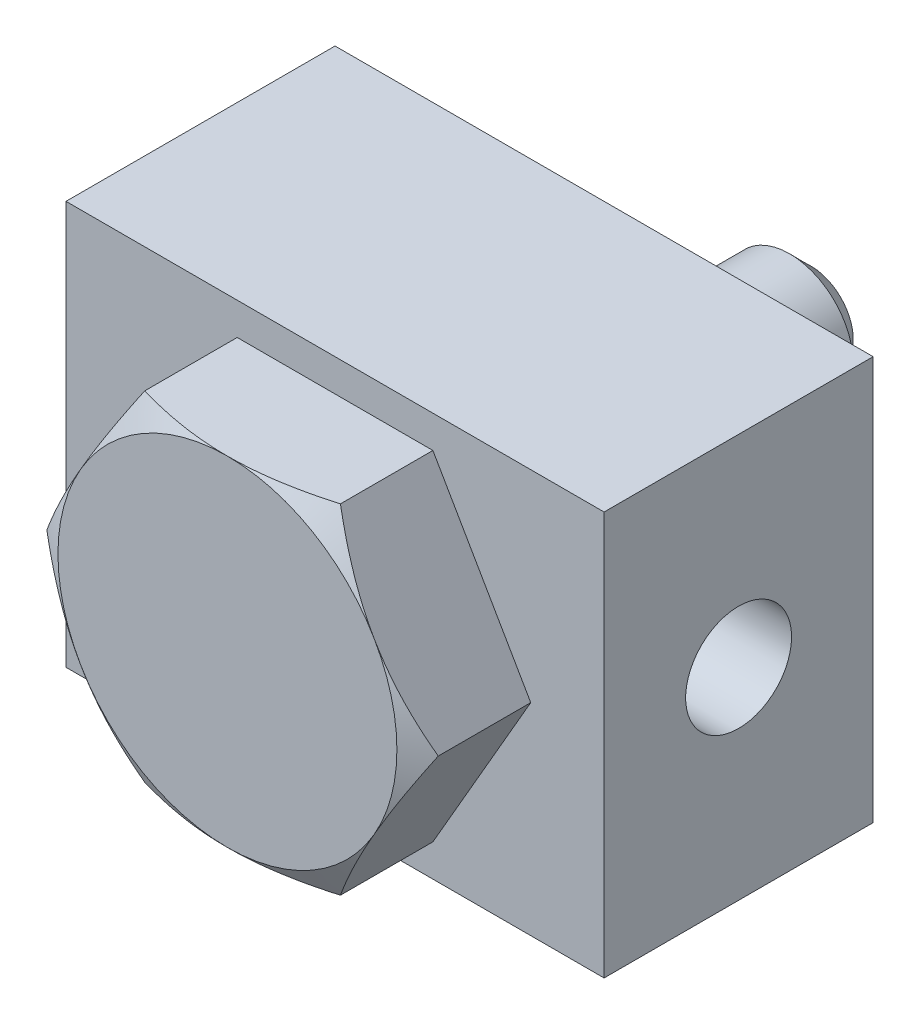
ISO-10303-21;
HEADER;
FILE_DESCRIPTION(('STEP AP214'),'2;1');
FILE_NAME('part.step','',(''),(''),'','','');
FILE_SCHEMA(('AUTOMOTIVE_DESIGN { 1 0 10303 214 1 1 1 1 }'));
ENDSEC;
DATA;
#1=APPLICATION_CONTEXT('core data for automotive mechanical design processes');
#2=APPLICATION_PROTOCOL_DEFINITION('international standard','automotive_design',2000,#1);
#3=PRODUCT_CONTEXT('',#1,'mechanical');
#4=PRODUCT('Part','Part','',(#3));
#5=PRODUCT_RELATED_PRODUCT_CATEGORY('part','',(#4));
#6=PRODUCT_DEFINITION_FORMATION('','',#4);
#7=PRODUCT_DEFINITION_CONTEXT('part definition',#1,'design');
#8=PRODUCT_DEFINITION('design','',#6,#7);
#9=PRODUCT_DEFINITION_SHAPE('','',#8);
#10=(LENGTH_UNIT() NAMED_UNIT(*) SI_UNIT(.MILLI.,.METRE.));
#11=(NAMED_UNIT(*) PLANE_ANGLE_UNIT() SI_UNIT($,.RADIAN.));
#12=(NAMED_UNIT(*) SI_UNIT($,.STERADIAN.) SOLID_ANGLE_UNIT());
#13=UNCERTAINTY_MEASURE_WITH_UNIT(LENGTH_MEASURE(1.E-05),#10,'distance_accuracy_value','');
#14=(GEOMETRIC_REPRESENTATION_CONTEXT(3) GLOBAL_UNCERTAINTY_ASSIGNED_CONTEXT((#13)) GLOBAL_UNIT_ASSIGNED_CONTEXT((#10,
#11,#12)) REPRESENTATION_CONTEXT('',''));
#15=CARTESIAN_POINT('',(0.,0.,0.));
#16=DIRECTION('',(0.,0.,1.));
#17=DIRECTION('',(1.,0.,0.));
#18=AXIS2_PLACEMENT_3D('',#15,#16,#17);
#19=CARTESIAN_POINT('',(25.4,-19.05,26.924));
#20=DIRECTION('',(0.,0.,1.));
#21=DIRECTION('',(0.,1.,0.));
#22=AXIS2_PLACEMENT_3D('',#19,#20,#21);
#23=PLANE('',#22);
#24=DIRECTION('',(0.,-1.,0.));
#25=VECTOR('',#24,1.);
#26=CARTESIAN_POINT('',(-25.4,0.,26.924));
#27=LINE('',#26,#25);
#28=CARTESIAN_POINT('',(-25.4,19.05,26.924));
#29=VERTEX_POINT('',#28);
#30=CARTESIAN_POINT('',(-25.4,-19.05,26.924));
#31=VERTEX_POINT('',#30);
#32=EDGE_CURVE('E270',#29,#31,#27,.T.);
#33=ORIENTED_EDGE('',*,*,#32,.T.);
#34=DIRECTION('',(1.,0.,0.));
#35=VECTOR('',#34,1.);
#36=CARTESIAN_POINT('',(0.,-19.05,26.924));
#37=LINE('',#36,#35);
#38=CARTESIAN_POINT('',(25.4,-19.05,26.924));
#39=VERTEX_POINT('',#38);
#40=EDGE_CURVE('E274',#31,#39,#37,.T.);
#41=ORIENTED_EDGE('',*,*,#40,.T.);
#42=DIRECTION('',(0.,1.,0.));
#43=VECTOR('',#42,1.);
#44=CARTESIAN_POINT('',(25.4,0.,26.924));
#45=LINE('',#44,#43);
#46=CARTESIAN_POINT('',(25.4,19.05,26.924));
#47=VERTEX_POINT('',#46);
#48=EDGE_CURVE('E281',#39,#47,#45,.T.);
#49=ORIENTED_EDGE('',*,*,#48,.T.);
#50=DIRECTION('',(-1.,0.,0.));
#51=VECTOR('',#50,1.);
#52=CARTESIAN_POINT('',(0.,19.05,26.924));
#53=LINE('',#52,#51);
#54=EDGE_CURVE('E289',#47,#29,#53,.T.);
#55=ORIENTED_EDGE('',*,*,#54,.T.);
#56=EDGE_LOOP('',(#33,#41,#49,#55));
#57=FACE_BOUND('',#56,.T.);
#58=DIRECTION('',(-0.5,-0.866025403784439,0.));
#59=VECTOR('',#58,1.);
#60=CARTESIAN_POINT('',(-9.23760430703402,16.,26.924));
#61=LINE('',#60,#59);
#62=CARTESIAN_POINT('',(-9.23760430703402,16.,26.924));
#63=VERTEX_POINT('',#62);
#64=CARTESIAN_POINT('',(-18.475208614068,0.,26.924));
#65=VERTEX_POINT('',#64);
#66=EDGE_CURVE('E368',#63,#65,#61,.T.);
#67=ORIENTED_EDGE('',*,*,#66,.F.);
#68=DIRECTION('',(-1.,0.,0.));
#69=VECTOR('',#68,1.);
#70=CARTESIAN_POINT('',(9.23760430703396,16.,26.924));
#71=LINE('',#70,#69);
#72=CARTESIAN_POINT('',(9.23760430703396,16.,26.924));
#73=VERTEX_POINT('',#72);
#74=EDGE_CURVE('E354',#73,#63,#71,.T.);
#75=ORIENTED_EDGE('',*,*,#74,.F.);
#76=DIRECTION('',(-0.5,0.866025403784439,0.));
#77=VECTOR('',#76,1.);
#78=CARTESIAN_POINT('',(18.475208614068,0.,26.924));
#79=LINE('',#78,#77);
#80=CARTESIAN_POINT('',(18.475208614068,0.,26.924));
#81=VERTEX_POINT('',#80);
#82=EDGE_CURVE('E357',#81,#73,#79,.T.);
#83=ORIENTED_EDGE('',*,*,#82,.F.);
#84=DIRECTION('',(0.5,0.866025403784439,0.));
#85=VECTOR('',#84,1.);
#86=CARTESIAN_POINT('',(9.23760430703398,-16.,26.924));
#87=LINE('',#86,#85);
#88=CARTESIAN_POINT('',(9.23760430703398,-16.,26.924));
#89=VERTEX_POINT('',#88);
#90=EDGE_CURVE('E360',#89,#81,#87,.T.);
#91=ORIENTED_EDGE('',*,*,#90,.F.);
#92=DIRECTION('',(1.,0.,0.));
#93=VECTOR('',#92,1.);
#94=CARTESIAN_POINT('',(-9.23760430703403,-16.,26.924));
#95=LINE('',#94,#93);
#96=CARTESIAN_POINT('',(-9.23760430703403,-16.,26.924));
#97=VERTEX_POINT('',#96);
#98=EDGE_CURVE('E363',#97,#89,#95,.T.);
#99=ORIENTED_EDGE('',*,*,#98,.F.);
#100=DIRECTION('',(0.5,-0.866025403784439,0.));
#101=VECTOR('',#100,1.);
#102=CARTESIAN_POINT('',(-18.475208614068,0.,26.924));
#103=LINE('',#102,#101);
#104=EDGE_CURVE('E366',#65,#97,#103,.T.);
#105=ORIENTED_EDGE('',*,*,#104,.F.);
#106=EDGE_LOOP('',(#67,#75,#83,#91,#99,#105));
#107=FACE_BOUND('',#106,.T.);
#108=ADVANCED_FACE('F14',(#57,#107),#23,.T.);
#109=CARTESIAN_POINT('',(-25.4,19.05,1.524));
#110=DIRECTION('',(0.,-1.,0.));
#111=DIRECTION('',(1.,0.,0.));
#112=AXIS2_PLACEMENT_3D('',#109,#110,#111);
#113=PLANE('',#112);
#114=DIRECTION('',(0.,0.,1.));
#115=VECTOR('',#114,1.);
#116=CARTESIAN_POINT('',(-25.4,19.05,14.224));
#117=LINE('',#116,#115);
#118=CARTESIAN_POINT('',(-25.4,19.05,1.524));
#119=VERTEX_POINT('',#118);
#120=EDGE_CURVE('E286',#119,#29,#117,.T.);
#121=ORIENTED_EDGE('',*,*,#120,.T.);
#122=ORIENTED_EDGE('',*,*,#54,.F.);
#123=DIRECTION('',(0.,0.,-1.));
#124=VECTOR('',#123,1.);
#125=CARTESIAN_POINT('',(25.4,19.05,14.224));
#126=LINE('',#125,#124);
#127=CARTESIAN_POINT('',(25.4,19.05,1.524));
#128=VERTEX_POINT('',#127);
#129=EDGE_CURVE('E331',#47,#128,#126,.T.);
#130=ORIENTED_EDGE('',*,*,#129,.T.);
#131=DIRECTION('',(-1.,0.,0.));
#132=VECTOR('',#131,1.);
#133=CARTESIAN_POINT('',(0.,19.05,1.524));
#134=LINE('',#133,#132);
#135=EDGE_CURVE('E335',#128,#119,#134,.T.);
#136=ORIENTED_EDGE('',*,*,#135,.T.);
#137=EDGE_LOOP('',(#121,#122,#130,#136));
#138=FACE_BOUND('',#137,.T.);
#139=ADVANCED_FACE('F221',(#138),#113,.F.);
#140=CARTESIAN_POINT('',(-25.4,-19.05,1.524));
#141=DIRECTION('',(1.,0.,0.));
#142=DIRECTION('',(0.,1.,0.));
#143=AXIS2_PLACEMENT_3D('',#140,#141,#142);
#144=PLANE('',#143);
#145=CARTESIAN_POINT('',(-25.4,0.,14.224));
#146=DIRECTION('',(1.,0.,0.));
#147=DIRECTION('',(0.,0.,-1.));
#148=AXIS2_PLACEMENT_3D('',#145,#146,#147);
#149=CIRCLE('',#148,5.);
#150=CARTESIAN_POINT('',(-25.4,0.,9.224));
#151=VERTEX_POINT('',#150);
#152=EDGE_CURVE('E132',#151,#151,#149,.T.);
#153=ORIENTED_EDGE('',*,*,#152,.T.);
#154=EDGE_LOOP('',(#153));
#155=FACE_BOUND('',#154,.T.);
#156=DIRECTION('',(0.,0.,1.));
#157=VECTOR('',#156,1.);
#158=CARTESIAN_POINT('',(-25.4,-19.05,14.224));
#159=LINE('',#158,#157);
#160=CARTESIAN_POINT('',(-25.4,-19.05,1.524));
#161=VERTEX_POINT('',#160);
#162=EDGE_CURVE('E267',#161,#31,#159,.T.);
#163=ORIENTED_EDGE('',*,*,#162,.T.);
#164=ORIENTED_EDGE('',*,*,#32,.F.);
#165=ORIENTED_EDGE('',*,*,#120,.F.);
#166=DIRECTION('',(0.,-1.,0.));
#167=VECTOR('',#166,1.);
#168=CARTESIAN_POINT('',(-25.4,0.,1.524));
#169=LINE('',#168,#167);
#170=EDGE_CURVE('E272',#119,#161,#169,.T.);
#171=ORIENTED_EDGE('',*,*,#170,.T.);
#172=EDGE_LOOP('',(#163,#164,#165,#171));
#173=FACE_BOUND('',#172,.T.);
#174=ADVANCED_FACE('F228',(#155,#173),#144,.F.);
#175=CARTESIAN_POINT('',(25.4,-19.05,1.524));
#176=DIRECTION('',(0.,1.,0.));
#177=DIRECTION('',(-1.,0.,0.));
#178=AXIS2_PLACEMENT_3D('',#175,#176,#177);
#179=PLANE('',#178);
#180=DIRECTION('',(0.,0.,1.));
#181=VECTOR('',#180,1.);
#182=CARTESIAN_POINT('',(25.4,-19.05,14.224));
#183=LINE('',#182,#181);
#184=CARTESIAN_POINT('',(25.4,-19.05,1.524));
#185=VERTEX_POINT('',#184);
#186=EDGE_CURVE('E278',#185,#39,#183,.T.);
#187=ORIENTED_EDGE('',*,*,#186,.T.);
#188=ORIENTED_EDGE('',*,*,#40,.F.);
#189=ORIENTED_EDGE('',*,*,#162,.F.);
#190=DIRECTION('',(1.,0.,0.));
#191=VECTOR('',#190,1.);
#192=CARTESIAN_POINT('',(0.,-19.05,1.524));
#193=LINE('',#192,#191);
#194=EDGE_CURVE('E340',#161,#185,#193,.T.);
#195=ORIENTED_EDGE('',*,*,#194,.T.);
#196=EDGE_LOOP('',(#187,#188,#189,#195));
#197=FACE_BOUND('',#196,.T.);
#198=ADVANCED_FACE('F252',(#197),#179,.F.);
#199=CARTESIAN_POINT('',(25.4,19.05,1.524));
#200=DIRECTION('',(-1.,0.,0.));
#201=DIRECTION('',(0.,-1.,0.));
#202=AXIS2_PLACEMENT_3D('',#199,#200,#201);
#203=PLANE('',#202);
#204=CARTESIAN_POINT('',(25.4,0.,14.224));
#205=DIRECTION('',(1.,0.,0.));
#206=DIRECTION('',(0.,0.,-1.));
#207=AXIS2_PLACEMENT_3D('',#204,#205,#206);
#208=CIRCLE('',#207,5.);
#209=CARTESIAN_POINT('',(25.4,0.,9.224));
#210=VERTEX_POINT('',#209);
#211=EDGE_CURVE('E326',#210,#210,#208,.T.);
#212=ORIENTED_EDGE('',*,*,#211,.F.);
#213=EDGE_LOOP('',(#212));
#214=FACE_BOUND('',#213,.T.);
#215=ORIENTED_EDGE('',*,*,#129,.F.);
#216=ORIENTED_EDGE('',*,*,#48,.F.);
#217=ORIENTED_EDGE('',*,*,#186,.F.);
#218=DIRECTION('',(0.,1.,0.));
#219=VECTOR('',#218,1.);
#220=CARTESIAN_POINT('',(25.4,0.,1.524));
#221=LINE('',#220,#219);
#222=EDGE_CURVE('E295',#185,#128,#221,.T.);
#223=ORIENTED_EDGE('',*,*,#222,.T.);
#224=EDGE_LOOP('',(#215,#216,#217,#223));
#225=FACE_BOUND('',#224,.T.);
#226=ADVANCED_FACE('F248',(#214,#225),#203,.F.);
#227=CARTESIAN_POINT('',(25.4,-19.05,1.524));
#228=DIRECTION('',(0.,0.,1.));
#229=DIRECTION('',(0.,1.,0.));
#230=AXIS2_PLACEMENT_3D('',#227,#228,#229);
#231=PLANE('',#230);
#232=CARTESIAN_POINT('',(0.,0.,1.524));
#233=DIRECTION('',(0.,0.,1.));
#234=DIRECTION('',(1.,0.,0.));
#235=AXIS2_PLACEMENT_3D('',#232,#233,#234);
#236=CIRCLE('',#235,12.6365);
#237=CARTESIAN_POINT('',(12.6365,0.,1.524));
#238=VERTEX_POINT('',#237);
#239=EDGE_CURVE('E293',#238,#238,#236,.T.);
#240=ORIENTED_EDGE('',*,*,#239,.T.);
#241=EDGE_LOOP('',(#240));
#242=FACE_BOUND('',#241,.T.);
#243=ORIENTED_EDGE('',*,*,#194,.F.);
#244=ORIENTED_EDGE('',*,*,#170,.F.);
#245=ORIENTED_EDGE('',*,*,#135,.F.);
#246=ORIENTED_EDGE('',*,*,#222,.F.);
#247=EDGE_LOOP('',(#243,#244,#245,#246));
#248=FACE_BOUND('',#247,.T.);
#249=ADVANCED_FACE('F241',(#242,#248),#231,.F.);
#250=CARTESIAN_POINT('',(0.,0.,0.));
#251=DIRECTION('',(0.,0.,1.));
#252=DIRECTION('',(1.,0.,0.));
#253=AXIS2_PLACEMENT_3D('',#250,#251,#252);
#254=CYLINDRICAL_SURFACE('',#253,12.6365);
#255=ORIENTED_EDGE('',*,*,#239,.F.);
#256=EDGE_LOOP('',(#255));
#257=FACE_BOUND('',#256,.T.);
#258=CARTESIAN_POINT('',(0.,0.,0.));
#259=DIRECTION('',(0.,0.,1.));
#260=DIRECTION('',(1.,0.,0.));
#261=AXIS2_PLACEMENT_3D('',#258,#259,#260);
#262=CIRCLE('',#261,12.6365);
#263=CARTESIAN_POINT('',(12.6365,0.,0.));
#264=VERTEX_POINT('',#263);
#265=EDGE_CURVE('E127',#264,#264,#262,.T.);
#266=ORIENTED_EDGE('',*,*,#265,.T.);
#267=EDGE_LOOP('',(#266));
#268=FACE_BOUND('',#267,.T.);
#269=ADVANCED_FACE('F234',(#257,#268),#254,.T.);
#270=CARTESIAN_POINT('',(12.788138,-12.788138,0.));
#271=DIRECTION('',(0.,0.,1.));
#272=DIRECTION('',(0.,1.,0.));
#273=AXIS2_PLACEMENT_3D('',#270,#271,#272);
#274=PLANE('',#273);
#275=CARTESIAN_POINT('',(0.,0.,0.));
#276=DIRECTION('',(0.,0.,1.));
#277=DIRECTION('',(1.,0.,0.));
#278=AXIS2_PLACEMENT_3D('',#275,#276,#277);
#279=CIRCLE('',#278,6.);
#280=CARTESIAN_POINT('',(6.,0.,0.));
#281=VERTEX_POINT('',#280);
#282=EDGE_CURVE('E297',#281,#281,#279,.F.);
#283=ORIENTED_EDGE('',*,*,#282,.F.);
#284=EDGE_LOOP('',(#283));
#285=FACE_BOUND('',#284,.T.);
#286=ORIENTED_EDGE('',*,*,#265,.F.);
#287=EDGE_LOOP('',(#286));
#288=FACE_BOUND('',#287,.T.);
#289=ADVANCED_FACE('F224',(#285,#288),#274,.F.);
#290=CARTESIAN_POINT('',(9.23760430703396,16.,85.9648074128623));
#291=DIRECTION('',(0.,-1.,0.));
#292=DIRECTION('',(0.,0.,-1.));
#293=AXIS2_PLACEMENT_3D('',#290,#291,#292);
#294=PLANE('',#293);
#295=DIRECTION('',(0.,0.,-1.));
#296=VECTOR('',#295,1.);
#297=CARTESIAN_POINT('',(-9.23760430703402,16.,85.9648074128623));
#298=LINE('',#297,#296);
#299=CARTESIAN_POINT('',(-9.23760430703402,16.,35.6549376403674));
#300=VERTEX_POINT('',#299);
#301=EDGE_CURVE('E352',#300,#63,#298,.T.);
#302=ORIENTED_EDGE('',*,*,#301,.F.);
#303=CARTESIAN_POINT('',(-24.7828534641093,16.,29.2903602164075));
#304=CARTESIAN_POINT('',(-24.4335876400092,16.,29.459767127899));
#305=CARTESIAN_POINT('',(-24.0839111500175,16.,29.6283269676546));
#306=CARTESIAN_POINT('',(-23.3836511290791,16.,29.9635606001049));
#307=CARTESIAN_POINT('',(-23.0330675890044,16.,30.1302343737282));
#308=CARTESIAN_POINT('',(-21.9797340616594,16.,30.6271828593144));
#309=CARTESIAN_POINT('',(-21.2755049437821,16.,30.9543342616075));
#310=CARTESIAN_POINT('',(-19.8584767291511,16.,31.6000921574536));
#311=CARTESIAN_POINT('',(-19.1456518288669,16.,31.9186421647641));
#312=CARTESIAN_POINT('',(-17.7143226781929,16.,32.5426708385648));
#313=CARTESIAN_POINT('',(-16.9958186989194,16.,32.8481501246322));
#314=CARTESIAN_POINT('',(-15.5288862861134,16.,33.4520887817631));
#315=CARTESIAN_POINT('',(-14.7802356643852,16.,33.7500112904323));
#316=CARTESIAN_POINT('',(-13.2741590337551,16.,34.3232355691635));
#317=CARTESIAN_POINT('',(-12.5167320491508,16.,34.5985347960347));
#318=CARTESIAN_POINT('',(-10.9933501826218,16.,35.1192587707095));
#319=CARTESIAN_POINT('',(-10.2274162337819,16.,35.3647442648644));
#320=CARTESIAN_POINT('',(-8.68448857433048,16.,35.8179568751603));
#321=CARTESIAN_POINT('',(-7.90749844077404,16.,36.0256959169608));
#322=CARTESIAN_POINT('',(-6.73574228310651,16.,36.3008931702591));
#323=CARTESIAN_POINT('',(-6.34518299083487,16.,36.3863734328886));
#324=CARTESIAN_POINT('',(-5.56140146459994,16.,36.5441763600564));
#325=CARTESIAN_POINT('',(-5.16817928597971,16.,36.6164992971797));
#326=CARTESIAN_POINT('',(-4.37934403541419,16.,36.7467093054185));
#327=CARTESIAN_POINT('',(-3.98373098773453,16.,36.8045965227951));
#328=CARTESIAN_POINT('',(-3.19053881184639,16.,36.9047786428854));
#329=CARTESIAN_POINT('',(-2.792959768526,16.,36.9470742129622));
#330=CARTESIAN_POINT('',(-2.00156556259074,16.,37.014704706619));
#331=CARTESIAN_POINT('',(-1.60776876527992,16.,37.0402532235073));
#332=CARTESIAN_POINT('',(-0.819448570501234,16.,37.0746762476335));
#333=CARTESIAN_POINT('',(-0.424925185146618,16.,37.0835510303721));
#334=CARTESIAN_POINT('',(0.364144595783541,16.,37.0844156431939));
#335=CARTESIAN_POINT('',(0.758690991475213,16.,37.0764053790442));
#336=CARTESIAN_POINT('',(1.5470954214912,16.,37.0436946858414));
#337=CARTESIAN_POINT('',(1.94095342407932,16.,37.0189935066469));
#338=CARTESIAN_POINT('',(2.88845903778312,16.,36.9400151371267));
#339=CARTESIAN_POINT('',(3.4414537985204,16.,36.8777663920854));
#340=CARTESIAN_POINT('',(4.54332219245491,16.,36.7237629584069));
#341=CARTESIAN_POINT('',(5.0921952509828,16.,36.632004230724));
#342=CARTESIAN_POINT('',(6.18530345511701,16.,36.4222451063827));
#343=CARTESIAN_POINT('',(6.72953461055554,16.,36.3042241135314));
#344=CARTESIAN_POINT('',(7.81252909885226,16.,36.0455404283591));
#345=CARTESIAN_POINT('',(8.35129251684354,16.,35.9048780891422));
#346=CARTESIAN_POINT('',(9.43514463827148,16.,35.6010235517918));
#347=CARTESIAN_POINT('',(9.98011296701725,16.,35.4374049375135));
#348=CARTESIAN_POINT('',(11.0646808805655,16.,35.0933385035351));
#349=CARTESIAN_POINT('',(11.6042804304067,16.,34.9128905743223));
#350=CARTESIAN_POINT('',(12.6783784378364,16.,34.5380239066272));
#351=CARTESIAN_POINT('',(13.2128785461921,16.,34.3436098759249));
#352=CARTESIAN_POINT('',(14.2774552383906,16.,33.9430906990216));
#353=CARTESIAN_POINT('',(14.8075318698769,16.,33.7369856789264));
#354=CARTESIAN_POINT('',(16.0410779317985,16.,33.2441875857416));
#355=CARTESIAN_POINT('',(16.7430164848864,16.,32.9536686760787));
#356=CARTESIAN_POINT('',(18.1410516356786,16.,32.358859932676));
#357=CARTESIAN_POINT('',(18.8371478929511,16.,32.0545693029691));
#358=CARTESIAN_POINT('',(20.2245621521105,16.,31.4349249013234));
#359=CARTESIAN_POINT('',(20.9158791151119,16.,31.1195688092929));
#360=CARTESIAN_POINT('',(22.2943699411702,16.,30.4799843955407));
#361=CARTESIAN_POINT('',(22.9815438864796,16.,30.155756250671));
#362=CARTESIAN_POINT('',(24.3531421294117,16.,29.4997147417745));
#363=CARTESIAN_POINT('',(25.037562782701,16.,29.1678937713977));
#364=CARTESIAN_POINT('',(26.4034728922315,16.,28.498274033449));
#365=CARTESIAN_POINT('',(27.0849623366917,16.,28.1604752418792));
#366=CARTESIAN_POINT('',(28.4453702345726,16.,27.4799504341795));
#367=CARTESIAN_POINT('',(29.1242889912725,16.,27.1372250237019));
#368=CARTESIAN_POINT('',(30.4800046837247,16.,26.4476006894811));
#369=CARTESIAN_POINT('',(31.1568016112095,16.,26.1007017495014));
#370=CARTESIAN_POINT('',(33.0738482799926,16.,25.1117976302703));
#371=CARTESIAN_POINT('',(34.3119474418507,16.,24.4656234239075));
#372=CARTESIAN_POINT('',(36.7835083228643,16.,23.1643877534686));
#373=CARTESIAN_POINT('',(38.0169698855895,16.,22.5093259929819));
#374=CARTESIAN_POINT('',(40.4772787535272,16.,21.1939634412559));
#375=CARTESIAN_POINT('',(41.7041348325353,16.,20.5336790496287));
#376=CARTESIAN_POINT('',(43.5422223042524,16.,19.5392744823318));
#377=CARTESIAN_POINT('',(44.1545360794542,16.,19.2071520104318));
#378=CARTESIAN_POINT('',(45.3785132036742,16.,18.5417128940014));
#379=CARTESIAN_POINT('',(45.9901765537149,16.,18.2083962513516));
#380=CARTESIAN_POINT('',(46.6015511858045,16.,17.8745507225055));
#381=B_SPLINE_CURVE_WITH_KNOTS('',3,(#303,#304,#305,#306,#307,#308,#309,#310,#311,#312,#313,
#314,#315,#316,#317,#318,#319,#320,#321,#322,#323,#324,#325,#326,#327,#328,#329,#330,#331,#332,
#333,#334,#335,#336,#337,#338,#339,#340,#341,#342,#343,#344,#345,#346,#347,#348,#349,#350,#351,
#352,#353,#354,#355,#356,#357,#358,#359,#360,#361,#362,#363,#364,#365,#366,#367,#368,#369,#370,
#371,#372,#373,#374,#375,#376,#377,#378,#379,#380),.UNSPECIFIED.,.F.,.F.,(4,2,2,2,2,2,2,2,2,2,2,
2,2,2,2,2,2,2,2,2,2,2,2,2,2,2,2,2,2,2,2,2,2,2,2,2,2,2,4),(0.,1.16454408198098,2.32909992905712,
4.65855780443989,7.00074953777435,9.3428301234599,11.7598056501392,14.1770525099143,
16.589288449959,19.0007609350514,20.1999878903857,21.3991899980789,22.5983799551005,
23.7975185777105,24.9810492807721,26.1645604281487,27.3480781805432,28.5316491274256,
30.2001870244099,31.8689533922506,33.5390331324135,35.2090868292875,36.915763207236,
38.6224506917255,40.3285655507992,42.0346620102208,44.313514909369,46.5924996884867,
48.8719651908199,51.1513852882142,53.4331985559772,55.7150209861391,57.9965652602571,
60.2781184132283,64.4677985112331,68.6576186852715,72.8373569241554,74.9271170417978,
77.0168738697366),.UNSPECIFIED.);
#382=CARTESIAN_POINT('',(0.,16.,37.084));
#383=VERTEX_POINT('',#382);
#384=EDGE_CURVE('E37',#300,#383,#381,.T.);
#385=ORIENTED_EDGE('',*,*,#384,.T.);
#386=CARTESIAN_POINT('',(9.23760430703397,16.,35.6549376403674));
#387=VERTEX_POINT('',#386);
#388=EDGE_CURVE('E193',#383,#387,#381,.T.);
#389=ORIENTED_EDGE('',*,*,#388,.T.);
#390=DIRECTION('',(0.,0.,-1.));
#391=VECTOR('',#390,1.);
#392=CARTESIAN_POINT('',(9.23760430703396,16.,85.9648074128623));
#393=LINE('',#392,#391);
#394=EDGE_CURVE('E350',#387,#73,#393,.T.);
#395=ORIENTED_EDGE('',*,*,#394,.T.);
#396=ORIENTED_EDGE('',*,*,#74,.T.);
#397=EDGE_LOOP('',(#302,#385,#389,#395,#396));
#398=FACE_BOUND('',#397,.T.);
#399=ADVANCED_FACE('F162',(#398),#294,.F.);
#400=CARTESIAN_POINT('',(18.475208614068,0.,85.9648074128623));
#401=DIRECTION('',(-0.866025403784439,-0.5,0.));
#402=DIRECTION('',(0.5,-0.866025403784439,0.));
#403=AXIS2_PLACEMENT_3D('',#400,#401,#402);
#404=PLANE('',#403);
#405=ORIENTED_EDGE('',*,*,#394,.F.);
#406=CARTESIAN_POINT('',(9.23748883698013,16.0002,35.6548709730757));
#407=CARTESIAN_POINT('',(9.44052768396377,15.6485264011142,35.7720876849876));
#408=CARTESIAN_POINT('',(9.64435849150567,15.2954810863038,35.8839853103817));
#409=CARTESIAN_POINT('',(10.0536545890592,14.5865594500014,36.0956638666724));
#410=CARTESIAN_POINT('',(10.2591203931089,14.2306822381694,36.1954408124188));
#411=CARTESIAN_POINT('',(10.672083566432,13.5154090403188,36.3815367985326));
#412=CARTESIAN_POINT('',(10.8795845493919,13.1560067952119,36.4678239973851));
#413=CARTESIAN_POINT('',(11.296028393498,12.4347048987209,36.62508765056));
#414=CARTESIAN_POINT('',(11.5049711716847,12.0728053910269,36.6960649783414));
#415=CARTESIAN_POINT('',(11.918944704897,11.3557821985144,36.8196899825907));
#416=CARTESIAN_POINT('',(12.123944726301,11.00071174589,36.8727468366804));
#417=CARTESIAN_POINT('',(12.5348841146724,10.2889438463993,36.9617113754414));
#418=CARTESIAN_POINT('',(12.7408234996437,9.9322463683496,36.9976187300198));
#419=CARTESIAN_POINT('',(13.1530482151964,9.21825221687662,37.0513776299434));
#420=CARTESIAN_POINT('',(13.3593328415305,8.86095676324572,37.0692506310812));
#421=CARTESIAN_POINT('',(13.7720925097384,8.14603604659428,37.0865564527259));
#422=CARTESIAN_POINT('',(13.9785675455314,7.78841079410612,37.0859898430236));
#423=CARTESIAN_POINT('',(14.3645705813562,7.11983392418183,37.0677045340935));
#424=CARTESIAN_POINT('',(14.5441260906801,6.80883465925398,37.0522162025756));
#425=CARTESIAN_POINT('',(14.902824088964,6.18755150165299,37.0075864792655));
#426=CARTESIAN_POINT('',(15.0819665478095,5.87726766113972,36.9784441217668));
#427=CARTESIAN_POINT('',(15.4397411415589,5.2575838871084,36.9070144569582));
#428=CARTESIAN_POINT('',(15.6183727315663,4.94818489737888,36.8647162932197));
#429=CARTESIAN_POINT('',(15.9747984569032,4.33083743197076,36.7677171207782));
#430=CARTESIAN_POINT('',(16.1525925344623,4.02288905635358,36.7130152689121));
#431=CARTESIAN_POINT('',(16.6922962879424,3.08809473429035,36.5289213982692));
#432=CARTESIAN_POINT('',(17.0526430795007,2.46395578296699,36.3811733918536));
#433=CARTESIAN_POINT('',(17.7679634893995,1.2249844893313,36.0458459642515));
#434=CARTESIAN_POINT('',(18.1229462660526,0.610136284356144,35.8583452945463));
#435=CARTESIAN_POINT('',(18.4753240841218,-0.00019999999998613,35.6548709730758));
#436=B_SPLINE_CURVE_WITH_KNOTS('',3,(#406,#407,#408,#409,#410,#411,#412,#413,#414,#415,#416,
#417,#418,#419,#420,#421,#422,#423,#424,#425,#426,#427,#428,#429,#430,#431,#432,#433,#434,#435),
.UNSPECIFIED.,.F.,.F.,(4,2,2,2,2,2,2,2,2,2,2,2,2,2,4),(0.,1.26800386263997,2.53642350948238,
3.80779337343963,5.07909068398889,6.31900943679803,7.55895205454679,8.7974177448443,
10.0358451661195,11.1139198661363,12.1920708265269,13.2711138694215,14.350230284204,
16.555917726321,18.7572757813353),.UNSPECIFIED.);
#437=CARTESIAN_POINT('',(13.856406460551,8.,37.084));
#438=VERTEX_POINT('',#437);
#439=EDGE_CURVE('E191',#387,#438,#436,.T.);
#440=ORIENTED_EDGE('',*,*,#439,.T.);
#441=CARTESIAN_POINT('',(18.475208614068,0.,35.6549376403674));
#442=VERTEX_POINT('',#441);
#443=EDGE_CURVE('E185',#438,#442,#436,.T.);
#444=ORIENTED_EDGE('',*,*,#443,.T.);
#445=DIRECTION('',(0.,0.,-1.));
#446=VECTOR('',#445,1.);
#447=CARTESIAN_POINT('',(18.475208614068,0.,85.9648074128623));
#448=LINE('',#447,#446);
#449=EDGE_CURVE('E348',#442,#81,#448,.T.);
#450=ORIENTED_EDGE('',*,*,#449,.T.);
#451=ORIENTED_EDGE('',*,*,#82,.T.);
#452=EDGE_LOOP('',(#405,#440,#444,#450,#451));
#453=FACE_BOUND('',#452,.T.);
#454=ADVANCED_FACE('F199',(#453),#404,.F.);
#455=CARTESIAN_POINT('',(9.23760430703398,-16.,85.9648074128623));
#456=DIRECTION('',(-0.866025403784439,0.5,0.));
#457=DIRECTION('',(-0.5,-0.866025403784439,0.));
#458=AXIS2_PLACEMENT_3D('',#455,#456,#457);
#459=PLANE('',#458);
#460=ORIENTED_EDGE('',*,*,#449,.F.);
#461=CARTESIAN_POINT('',(18.4753240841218,0.000200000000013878,35.6548709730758));
#462=CARTESIAN_POINT('',(18.2722852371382,-0.351473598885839,35.7720876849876));
#463=CARTESIAN_POINT('',(18.0684544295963,-0.704518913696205,35.8839853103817));
#464=CARTESIAN_POINT('',(17.6591583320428,-1.41344054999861,36.0956638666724));
#465=CARTESIAN_POINT('',(17.4536925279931,-1.76931776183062,36.1954408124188));
#466=CARTESIAN_POINT('',(17.0407293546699,-2.48459095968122,36.3815367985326));
#467=CARTESIAN_POINT('',(16.8332283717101,-2.84399320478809,36.4678239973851));
#468=CARTESIAN_POINT('',(16.416784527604,-3.56529510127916,36.62508765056));
#469=CARTESIAN_POINT('',(16.2078417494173,-3.92719460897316,36.6960649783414));
#470=CARTESIAN_POINT('',(15.793868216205,-4.64421780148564,36.8196899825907));
#471=CARTESIAN_POINT('',(15.588868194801,-4.99928825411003,36.8727468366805));
#472=CARTESIAN_POINT('',(15.1779288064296,-5.71105615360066,36.9617113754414));
#473=CARTESIAN_POINT('',(14.9719894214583,-6.06775363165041,36.9976187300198));
#474=CARTESIAN_POINT('',(14.5597647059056,-6.78174778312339,37.0513776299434));
#475=CARTESIAN_POINT('',(14.3534800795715,-7.13904323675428,37.0692506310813));
#476=CARTESIAN_POINT('',(13.9407204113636,-7.85396395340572,37.0865564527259));
#477=CARTESIAN_POINT('',(13.7342453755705,-8.21158920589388,37.0859898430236));
#478=CARTESIAN_POINT('',(13.3482423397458,-8.88016607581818,37.0677045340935));
#479=CARTESIAN_POINT('',(13.1686868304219,-9.19116534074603,37.0522162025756));
#480=CARTESIAN_POINT('',(12.809988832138,-9.81244849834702,37.0075864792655));
#481=CARTESIAN_POINT('',(12.6308463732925,-10.1227323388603,36.9784441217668));
#482=CARTESIAN_POINT('',(12.273071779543,-10.7424161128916,36.9070144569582));
#483=CARTESIAN_POINT('',(12.0944401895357,-11.0518151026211,36.8647162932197));
#484=CARTESIAN_POINT('',(11.7380144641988,-11.6691625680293,36.7677171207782));
#485=CARTESIAN_POINT('',(11.5602203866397,-11.9771109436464,36.7130152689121));
#486=CARTESIAN_POINT('',(11.0205166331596,-12.9119052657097,36.5289213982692));
#487=CARTESIAN_POINT('',(10.6601698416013,-13.536044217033,36.3811733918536));
#488=CARTESIAN_POINT('',(9.9448494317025,-14.7750155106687,36.0458459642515));
#489=CARTESIAN_POINT('',(9.58986665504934,-15.3898637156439,35.8583452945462));
#490=CARTESIAN_POINT('',(9.23748883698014,-16.0002,35.6548709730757));
#491=B_SPLINE_CURVE_WITH_KNOTS('',3,(#461,#462,#463,#464,#465,#466,#467,#468,#469,#470,#471,
#472,#473,#474,#475,#476,#477,#478,#479,#480,#481,#482,#483,#484,#485,#486,#487,#488,#489,#490),
.UNSPECIFIED.,.F.,.F.,(4,2,2,2,2,2,2,2,2,2,2,2,2,2,4),(0.,1.26800386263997,2.53642350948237,
3.80779337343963,5.07909068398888,6.31900943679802,7.55895205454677,8.79741774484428,
10.0358451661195,11.1139198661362,12.1920708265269,13.2711138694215,14.350230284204,
16.5559177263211,18.7572757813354),.UNSPECIFIED.);
#492=CARTESIAN_POINT('',(13.856406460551,-8.,37.084));
#493=VERTEX_POINT('',#492);
#494=EDGE_CURVE('E192',#442,#493,#491,.T.);
#495=ORIENTED_EDGE('',*,*,#494,.T.);
#496=CARTESIAN_POINT('',(9.23760430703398,-16.,35.6549376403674));
#497=VERTEX_POINT('',#496);
#498=EDGE_CURVE('E178',#493,#497,#491,.T.);
#499=ORIENTED_EDGE('',*,*,#498,.T.);
#500=DIRECTION('',(0.,0.,-1.));
#501=VECTOR('',#500,1.);
#502=CARTESIAN_POINT('',(9.23760430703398,-16.,85.9648074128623));
#503=LINE('',#502,#501);
#504=EDGE_CURVE('E346',#497,#89,#503,.T.);
#505=ORIENTED_EDGE('',*,*,#504,.T.);
#506=ORIENTED_EDGE('',*,*,#90,.T.);
#507=EDGE_LOOP('',(#460,#495,#499,#505,#506));
#508=FACE_BOUND('',#507,.T.);
#509=ADVANCED_FACE('F202',(#508),#459,.F.);
#510=CARTESIAN_POINT('',(-9.23760430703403,-16.,85.9648074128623));
#511=DIRECTION('',(0.,1.,0.));
#512=DIRECTION('',(0.,0.,1.));
#513=AXIS2_PLACEMENT_3D('',#510,#511,#512);
#514=PLANE('',#513);
#515=ORIENTED_EDGE('',*,*,#504,.F.);
#516=CARTESIAN_POINT('',(-24.7828534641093,-16.,29.2903602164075));
#517=CARTESIAN_POINT('',(-24.4335876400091,-16.,29.4597671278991));
#518=CARTESIAN_POINT('',(-24.0839111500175,-16.,29.6283269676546));
#519=CARTESIAN_POINT('',(-23.383651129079,-16.,29.9635606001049));
#520=CARTESIAN_POINT('',(-23.0330675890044,-16.,30.1302343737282));
#521=CARTESIAN_POINT('',(-21.9797340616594,-16.,30.6271828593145));
#522=CARTESIAN_POINT('',(-21.275504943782,-16.,30.9543342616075));
#523=CARTESIAN_POINT('',(-19.8584767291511,-16.,31.6000921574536));
#524=CARTESIAN_POINT('',(-19.1456518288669,-16.,31.9186421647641));
#525=CARTESIAN_POINT('',(-17.7143226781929,-16.,32.5426708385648));
#526=CARTESIAN_POINT('',(-16.9958186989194,-16.,32.8481501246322));
#527=CARTESIAN_POINT('',(-15.5288862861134,-16.,33.4520887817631));
#528=CARTESIAN_POINT('',(-14.7802356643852,-16.,33.7500112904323));
#529=CARTESIAN_POINT('',(-13.2741590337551,-16.,34.3232355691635));
#530=CARTESIAN_POINT('',(-12.5167320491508,-16.,34.5985347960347));
#531=CARTESIAN_POINT('',(-10.9933501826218,-16.,35.1192587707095));
#532=CARTESIAN_POINT('',(-10.2274162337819,-16.,35.3647442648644));
#533=CARTESIAN_POINT('',(-8.68448857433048,-16.,35.8179568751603));
#534=CARTESIAN_POINT('',(-7.90749844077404,-16.,36.0256959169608));
#535=CARTESIAN_POINT('',(-6.73574228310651,-16.,36.3008931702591));
#536=CARTESIAN_POINT('',(-6.34518299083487,-16.,36.3863734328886));
#537=CARTESIAN_POINT('',(-5.56140146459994,-16.,36.5441763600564));
#538=CARTESIAN_POINT('',(-5.16817928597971,-16.,36.6164992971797));
#539=CARTESIAN_POINT('',(-4.3793440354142,-16.,36.7467093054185));
#540=CARTESIAN_POINT('',(-3.98373098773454,-16.,36.8045965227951));
#541=CARTESIAN_POINT('',(-3.1905388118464,-16.,36.9047786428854));
#542=CARTESIAN_POINT('',(-2.79295976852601,-16.,36.9470742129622));
#543=CARTESIAN_POINT('',(-2.00156556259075,-16.,37.014704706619));
#544=CARTESIAN_POINT('',(-1.60776876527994,-16.,37.0402532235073));
#545=CARTESIAN_POINT('',(-0.819448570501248,-16.,37.0746762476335));
#546=CARTESIAN_POINT('',(-0.424925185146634,-16.,37.0835510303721));
#547=CARTESIAN_POINT('',(0.364144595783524,-16.,37.0844156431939));
#548=CARTESIAN_POINT('',(0.758690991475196,-16.,37.0764053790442));
#549=CARTESIAN_POINT('',(1.54709542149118,-16.,37.0436946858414));
#550=CARTESIAN_POINT('',(1.9409534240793,-16.,37.0189935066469));
#551=CARTESIAN_POINT('',(2.88845903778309,-16.,36.9400151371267));
#552=CARTESIAN_POINT('',(3.44145379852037,-16.,36.8777663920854));
#553=CARTESIAN_POINT('',(4.54332219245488,-16.,36.7237629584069));
#554=CARTESIAN_POINT('',(5.09219525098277,-16.,36.632004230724));
#555=CARTESIAN_POINT('',(6.18530345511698,-16.,36.4222451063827));
#556=CARTESIAN_POINT('',(6.72953461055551,-16.,36.3042241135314));
#557=CARTESIAN_POINT('',(7.81252909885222,-16.,36.0455404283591));
#558=CARTESIAN_POINT('',(8.35129251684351,-16.,35.9048780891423));
#559=CARTESIAN_POINT('',(9.43514463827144,-16.,35.6010235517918));
#560=CARTESIAN_POINT('',(9.98011296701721,-16.,35.4374049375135));
#561=CARTESIAN_POINT('',(11.0646808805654,-16.,35.0933385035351));
#562=CARTESIAN_POINT('',(11.6042804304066,-16.,34.9128905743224));
#563=CARTESIAN_POINT('',(12.6783784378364,-16.,34.5380239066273));
#564=CARTESIAN_POINT('',(13.2128785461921,-16.,34.3436098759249));
#565=CARTESIAN_POINT('',(14.2774552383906,-16.,33.9430906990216));
#566=CARTESIAN_POINT('',(14.8075318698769,-16.,33.7369856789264));
#567=CARTESIAN_POINT('',(16.0410779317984,-16.,33.2441875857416));
#568=CARTESIAN_POINT('',(16.7430164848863,-16.,32.9536686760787));
#569=CARTESIAN_POINT('',(18.1410516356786,-16.,32.358859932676));
#570=CARTESIAN_POINT('',(18.8371478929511,-16.,32.0545693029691));
#571=CARTESIAN_POINT('',(20.2245621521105,-16.,31.4349249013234));
#572=CARTESIAN_POINT('',(20.9158791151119,-16.,31.1195688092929));
#573=CARTESIAN_POINT('',(22.2943699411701,-16.,30.4799843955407));
#574=CARTESIAN_POINT('',(22.9815438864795,-16.,30.155756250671));
#575=CARTESIAN_POINT('',(24.3531421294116,-16.,29.4997147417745));
#576=CARTESIAN_POINT('',(25.037562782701,-16.,29.1678937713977));
#577=CARTESIAN_POINT('',(26.4034728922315,-16.,28.498274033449));
#578=CARTESIAN_POINT('',(27.0849623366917,-16.,28.1604752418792));
#579=CARTESIAN_POINT('',(28.4453702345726,-16.,27.4799504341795));
#580=CARTESIAN_POINT('',(29.1242889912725,-16.,27.1372250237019));
#581=CARTESIAN_POINT('',(30.4800046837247,-16.,26.4476006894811));
#582=CARTESIAN_POINT('',(31.1568016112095,-16.,26.1007017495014));
#583=CARTESIAN_POINT('',(33.0738482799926,-16.,25.1117976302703));
#584=CARTESIAN_POINT('',(34.3119474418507,-16.,24.4656234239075));
#585=CARTESIAN_POINT('',(36.7835083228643,-16.,23.1643877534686));
#586=CARTESIAN_POINT('',(38.0169698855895,-16.,22.5093259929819));
#587=CARTESIAN_POINT('',(40.4772787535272,-16.,21.1939634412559));
#588=CARTESIAN_POINT('',(41.7041348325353,-16.,20.5336790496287));
#589=CARTESIAN_POINT('',(43.5422223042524,-16.,19.5392744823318));
#590=CARTESIAN_POINT('',(44.1545360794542,-16.,19.2071520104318));
#591=CARTESIAN_POINT('',(45.3785132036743,-16.,18.5417128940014));
#592=CARTESIAN_POINT('',(45.990176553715,-16.,18.2083962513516));
#593=CARTESIAN_POINT('',(46.6015511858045,-16.,17.8745507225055));
#594=B_SPLINE_CURVE_WITH_KNOTS('',3,(#516,#517,#518,#519,#520,#521,#522,#523,#524,#525,#526,
#527,#528,#529,#530,#531,#532,#533,#534,#535,#536,#537,#538,#539,#540,#541,#542,#543,#544,#545,
#546,#547,#548,#549,#550,#551,#552,#553,#554,#555,#556,#557,#558,#559,#560,#561,#562,#563,#564,
#565,#566,#567,#568,#569,#570,#571,#572,#573,#574,#575,#576,#577,#578,#579,#580,#581,#582,#583,
#584,#585,#586,#587,#588,#589,#590,#591,#592,#593),.UNSPECIFIED.,.F.,.F.,(4,2,2,2,2,2,2,2,2,2,2,
2,2,2,2,2,2,2,2,2,2,2,2,2,2,2,2,2,2,2,2,2,2,2,2,2,2,2,4),(0.,1.16454408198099,2.32909992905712,
4.65855780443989,7.00074953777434,9.34283012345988,11.7598056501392,14.1770525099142,
16.589288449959,19.0007609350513,20.1999878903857,21.3991899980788,22.5983799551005,
23.7975185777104,24.981049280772,26.1645604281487,27.3480781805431,28.5316491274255,
30.2001870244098,31.8689533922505,33.5390331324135,35.2090868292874,36.9157632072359,
38.6224506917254,40.3285655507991,42.0346620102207,44.3135149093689,46.5924996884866,
48.8719651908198,51.1513852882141,53.4331985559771,55.7150209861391,57.996565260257,
60.2781184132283,64.4677985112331,68.6576186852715,72.8373569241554,74.9271170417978,
77.0168738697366),.UNSPECIFIED.);
#595=CARTESIAN_POINT('',(0.,-16.,37.084));
#596=VERTEX_POINT('',#595);
#597=EDGE_CURVE('E386',#497,#596,#594,.F.);
#598=ORIENTED_EDGE('',*,*,#597,.T.);
#599=CARTESIAN_POINT('',(-9.23760430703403,-16.,35.6549376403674));
#600=VERTEX_POINT('',#599);
#601=EDGE_CURVE('E171',#596,#600,#594,.F.);
#602=ORIENTED_EDGE('',*,*,#601,.T.);
#603=DIRECTION('',(0.,0.,-1.));
#604=VECTOR('',#603,1.);
#605=CARTESIAN_POINT('',(-9.23760430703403,-16.,85.9648074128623));
#606=LINE('',#605,#604);
#607=EDGE_CURVE('E344',#600,#97,#606,.T.);
#608=ORIENTED_EDGE('',*,*,#607,.T.);
#609=ORIENTED_EDGE('',*,*,#98,.T.);
#610=EDGE_LOOP('',(#515,#598,#602,#608,#609));
#611=FACE_BOUND('',#610,.T.);
#612=ADVANCED_FACE('F206',(#611),#514,.F.);
#613=CARTESIAN_POINT('',(-18.475208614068,0.,85.9648074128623));
#614=DIRECTION('',(0.866025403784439,0.5,0.));
#615=DIRECTION('',(-0.5,0.866025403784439,0.));
#616=AXIS2_PLACEMENT_3D('',#613,#614,#615);
#617=PLANE('',#616);
#618=ORIENTED_EDGE('',*,*,#607,.F.);
#619=CARTESIAN_POINT('',(-9.23748883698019,-16.0002,35.6548709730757));
#620=CARTESIAN_POINT('',(-9.44052768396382,-15.6485264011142,35.7720876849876));
#621=CARTESIAN_POINT('',(-9.64435849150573,-15.2954810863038,35.8839853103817));
#622=CARTESIAN_POINT('',(-10.0536545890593,-14.5865594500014,36.0956638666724));
#623=CARTESIAN_POINT('',(-10.2591203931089,-14.2306822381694,36.1954408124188));
#624=CARTESIAN_POINT('',(-10.6720835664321,-13.5154090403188,36.3815367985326));
#625=CARTESIAN_POINT('',(-10.8795845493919,-13.1560067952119,36.4678239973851));
#626=CARTESIAN_POINT('',(-11.296028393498,-12.4347048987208,36.62508765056));
#627=CARTESIAN_POINT('',(-11.5049711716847,-12.0728053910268,36.6960649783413));
#628=CARTESIAN_POINT('',(-11.918944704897,-11.3557821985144,36.8196899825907));
#629=CARTESIAN_POINT('',(-12.123944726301,-11.00071174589,36.8727468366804));
#630=CARTESIAN_POINT('',(-12.5348841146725,-10.2889438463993,36.9617113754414));
#631=CARTESIAN_POINT('',(-12.7408234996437,-9.93224636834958,36.9976187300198));
#632=CARTESIAN_POINT('',(-13.1530482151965,-9.2182522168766,37.0513776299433));
#633=CARTESIAN_POINT('',(-13.3593328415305,-8.8609567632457,37.0692506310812));
#634=CARTESIAN_POINT('',(-13.7720925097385,-8.14603604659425,37.0865564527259));
#635=CARTESIAN_POINT('',(-13.9785675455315,-7.78841079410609,37.0859898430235));
#636=CARTESIAN_POINT('',(-14.3645705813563,-7.1198339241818,37.0677045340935));
#637=CARTESIAN_POINT('',(-14.5441260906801,-6.80883465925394,37.0522162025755));
#638=CARTESIAN_POINT('',(-14.902824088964,-6.18755150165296,37.0075864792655));
#639=CARTESIAN_POINT('',(-15.0819665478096,-5.87726766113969,36.9784441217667));
#640=CARTESIAN_POINT('',(-15.439741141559,-5.25758388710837,36.9070144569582));
#641=CARTESIAN_POINT('',(-15.6183727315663,-4.94818489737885,36.8647162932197));
#642=CARTESIAN_POINT('',(-15.9747984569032,-4.33083743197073,36.7677171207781));
#643=CARTESIAN_POINT('',(-16.1525925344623,-4.02288905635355,36.7130152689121));
#644=CARTESIAN_POINT('',(-16.6922962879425,-3.08809473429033,36.5289213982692));
#645=CARTESIAN_POINT('',(-17.0526430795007,-2.46395578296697,36.3811733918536));
#646=CARTESIAN_POINT('',(-17.7679634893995,-1.22498448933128,36.0458459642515));
#647=CARTESIAN_POINT('',(-18.1229462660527,-0.610136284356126,35.8583452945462));
#648=CARTESIAN_POINT('',(-18.4753240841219,0.000199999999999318,35.6548709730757));
#649=B_SPLINE_CURVE_WITH_KNOTS('',3,(#619,#620,#621,#622,#623,#624,#625,#626,#627,#628,#629,
#630,#631,#632,#633,#634,#635,#636,#637,#638,#639,#640,#641,#642,#643,#644,#645,#646,#647,#648),
.UNSPECIFIED.,.F.,.F.,(4,2,2,2,2,2,2,2,2,2,2,2,2,2,4),(0.,1.26800386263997,2.53642350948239,
3.80779337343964,5.0790906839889,6.31900943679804,7.5589520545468,8.79741774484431,
10.0358451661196,11.1139198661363,12.1920708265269,13.2711138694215,14.350230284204,
16.5559177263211,18.7572757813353),.UNSPECIFIED.);
#650=CARTESIAN_POINT('',(-13.856406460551,-8.,37.084));
#651=VERTEX_POINT('',#650);
#652=EDGE_CURVE('E138',#600,#651,#649,.T.);
#653=ORIENTED_EDGE('',*,*,#652,.T.);
#654=CARTESIAN_POINT('',(-18.475208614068,0.,35.6549376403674));
#655=VERTEX_POINT('',#654);
#656=EDGE_CURVE('E123',#651,#655,#649,.T.);
#657=ORIENTED_EDGE('',*,*,#656,.T.);
#658=DIRECTION('',(0.,0.,-1.));
#659=VECTOR('',#658,1.);
#660=CARTESIAN_POINT('',(-18.475208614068,0.,85.9648074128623));
#661=LINE('',#660,#659);
#662=EDGE_CURVE('E137',#655,#65,#661,.T.);
#663=ORIENTED_EDGE('',*,*,#662,.T.);
#664=ORIENTED_EDGE('',*,*,#104,.T.);
#665=EDGE_LOOP('',(#618,#653,#657,#663,#664));
#666=FACE_BOUND('',#665,.T.);
#667=ADVANCED_FACE('F210',(#666),#617,.F.);
#668=CARTESIAN_POINT('',(-9.23760430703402,16.,85.9648074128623));
#669=DIRECTION('',(0.866025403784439,-0.5,0.));
#670=DIRECTION('',(0.5,0.866025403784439,0.));
#671=AXIS2_PLACEMENT_3D('',#668,#669,#670);
#672=PLANE('',#671);
#673=ORIENTED_EDGE('',*,*,#662,.F.);
#674=CARTESIAN_POINT('',(-18.4753240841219,-0.0002,35.6548709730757));
#675=CARTESIAN_POINT('',(-18.2722852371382,0.351473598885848,35.7720876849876));
#676=CARTESIAN_POINT('',(-18.0684544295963,0.704518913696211,35.8839853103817));
#677=CARTESIAN_POINT('',(-17.6591583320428,1.41344054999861,36.0956638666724));
#678=CARTESIAN_POINT('',(-17.4536925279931,1.76931776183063,36.1954408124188));
#679=CARTESIAN_POINT('',(-17.04072935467,2.48459095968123,36.3815367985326));
#680=CARTESIAN_POINT('',(-16.8332283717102,2.8439932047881,36.4678239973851));
#681=CARTESIAN_POINT('',(-16.416784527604,3.56529510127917,36.62508765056));
#682=CARTESIAN_POINT('',(-16.2078417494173,3.92719460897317,36.6960649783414));
#683=CARTESIAN_POINT('',(-15.793868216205,4.64421780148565,36.8196899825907));
#684=CARTESIAN_POINT('',(-15.5888681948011,4.99928825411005,36.8727468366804));
#685=CARTESIAN_POINT('',(-15.1779288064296,5.71105615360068,36.9617113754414));
#686=CARTESIAN_POINT('',(-14.9719894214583,6.06775363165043,36.9976187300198));
#687=CARTESIAN_POINT('',(-14.5597647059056,6.78174778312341,37.0513776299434));
#688=CARTESIAN_POINT('',(-14.3534800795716,7.13904323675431,37.0692506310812));
#689=CARTESIAN_POINT('',(-13.9407204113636,7.85396395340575,37.0865564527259));
#690=CARTESIAN_POINT('',(-13.7342453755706,8.21158920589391,37.0859898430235));
#691=CARTESIAN_POINT('',(-13.3482423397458,8.8801660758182,37.0677045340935));
#692=CARTESIAN_POINT('',(-13.1686868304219,9.19116534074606,37.0522162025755));
#693=CARTESIAN_POINT('',(-12.809988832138,9.81244849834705,37.0075864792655));
#694=CARTESIAN_POINT('',(-12.6308463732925,10.1227323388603,36.9784441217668));
#695=CARTESIAN_POINT('',(-12.2730717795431,10.7424161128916,36.9070144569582));
#696=CARTESIAN_POINT('',(-12.0944401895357,11.0518151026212,36.8647162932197));
#697=CARTESIAN_POINT('',(-11.7380144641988,11.6691625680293,36.7677171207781));
#698=CARTESIAN_POINT('',(-11.5602203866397,11.9771109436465,36.7130152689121));
#699=CARTESIAN_POINT('',(-11.0205166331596,12.9119052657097,36.5289213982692));
#700=CARTESIAN_POINT('',(-10.6601698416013,13.536044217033,36.3811733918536));
#701=CARTESIAN_POINT('',(-9.94484943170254,14.7750155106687,36.0458459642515));
#702=CARTESIAN_POINT('',(-9.58986665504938,15.3898637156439,35.8583452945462));
#703=CARTESIAN_POINT('',(-9.23748883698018,16.0002,35.6548709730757));
#704=B_SPLINE_CURVE_WITH_KNOTS('',3,(#674,#675,#676,#677,#678,#679,#680,#681,#682,#683,#684,
#685,#686,#687,#688,#689,#690,#691,#692,#693,#694,#695,#696,#697,#698,#699,#700,#701,#702,#703),
.UNSPECIFIED.,.F.,.F.,(4,2,2,2,2,2,2,2,2,2,2,2,2,2,4),(0.,1.26800386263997,2.53642350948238,
3.80779337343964,5.07909068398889,6.31900943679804,7.55895205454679,8.79741774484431,
10.0358451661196,11.1139198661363,12.1920708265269,13.2711138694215,14.350230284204,
16.5559177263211,18.7572757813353),.UNSPECIFIED.);
#705=CARTESIAN_POINT('',(-13.856406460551,8.,37.084));
#706=VERTEX_POINT('',#705);
#707=EDGE_CURVE('E116',#655,#706,#704,.T.);
#708=ORIENTED_EDGE('',*,*,#707,.T.);
#709=EDGE_CURVE('E107',#706,#300,#704,.T.);
#710=ORIENTED_EDGE('',*,*,#709,.T.);
#711=ORIENTED_EDGE('',*,*,#301,.T.);
#712=ORIENTED_EDGE('',*,*,#66,.T.);
#713=EDGE_LOOP('',(#673,#708,#710,#711,#712));
#714=FACE_BOUND('',#713,.T.);
#715=ADVANCED_FACE('F135',(#714),#672,.F.);
#716=CARTESIAN_POINT('',(0.,0.,37.084));
#717=DIRECTION('',(0.,0.,-1.));
#718=DIRECTION('',(-1.,0.,0.));
#719=AXIS2_PLACEMENT_3D('',#716,#717,#718);
#720=CONICAL_SURFACE('',#719,16.,1.0471975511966);
#721=CARTESIAN_POINT('',(0.,0.,37.084));
#722=DIRECTION('',(0.,0.,-1.));
#723=DIRECTION('',(-1.,0.,0.));
#724=AXIS2_PLACEMENT_3D('',#721,#722,#723);
#725=CIRCLE('',#724,16.);
#726=EDGE_CURVE('E120',#706,#651,#725,.F.);
#727=ORIENTED_EDGE('',*,*,#726,.F.);
#728=ORIENTED_EDGE('',*,*,#707,.F.);
#729=ORIENTED_EDGE('',*,*,#656,.F.);
#730=EDGE_LOOP('',(#727,#728,#729));
#731=FACE_BOUND('',#730,.T.);
#732=ADVANCED_FACE('F121',(#731),#720,.T.);
#733=ORIENTED_EDGE('',*,*,#709,.F.);
#734=CARTESIAN_POINT('',(0.,0.,37.084));
#735=DIRECTION('',(0.,0.,-1.));
#736=DIRECTION('',(-1.,0.,0.));
#737=AXIS2_PLACEMENT_3D('',#734,#735,#736);
#738=CIRCLE('',#737,16.);
#739=EDGE_CURVE('E111',#706,#383,#738,.T.);
#740=ORIENTED_EDGE('',*,*,#739,.T.);
#741=ORIENTED_EDGE('',*,*,#384,.F.);
#742=EDGE_LOOP('',(#733,#740,#741));
#743=FACE_BOUND('',#742,.T.);
#744=ADVANCED_FACE('F109',(#743),#720,.T.);
#745=EDGE_CURVE('E126',#438,#383,#725,.F.);
#746=ORIENTED_EDGE('',*,*,#745,.F.);
#747=ORIENTED_EDGE('',*,*,#439,.F.);
#748=ORIENTED_EDGE('',*,*,#388,.F.);
#749=EDGE_LOOP('',(#746,#747,#748));
#750=FACE_BOUND('',#749,.T.);
#751=ADVANCED_FACE('F159',(#750),#720,.T.);
#752=EDGE_CURVE('E376',#493,#438,#725,.F.);
#753=ORIENTED_EDGE('',*,*,#752,.F.);
#754=ORIENTED_EDGE('',*,*,#494,.F.);
#755=ORIENTED_EDGE('',*,*,#443,.F.);
#756=EDGE_LOOP('',(#753,#754,#755));
#757=FACE_BOUND('',#756,.T.);
#758=ADVANCED_FACE('F390',(#757),#720,.T.);
#759=EDGE_CURVE('E380',#596,#493,#725,.F.);
#760=ORIENTED_EDGE('',*,*,#759,.F.);
#761=ORIENTED_EDGE('',*,*,#597,.F.);
#762=ORIENTED_EDGE('',*,*,#498,.F.);
#763=EDGE_LOOP('',(#760,#761,#762));
#764=FACE_BOUND('',#763,.T.);
#765=ADVANCED_FACE('F389',(#764),#720,.T.);
#766=EDGE_CURVE('E29',#651,#596,#725,.F.);
#767=ORIENTED_EDGE('',*,*,#766,.F.);
#768=ORIENTED_EDGE('',*,*,#652,.F.);
#769=ORIENTED_EDGE('',*,*,#601,.F.);
#770=EDGE_LOOP('',(#767,#768,#769));
#771=FACE_BOUND('',#770,.T.);
#772=ADVANCED_FACE('F322',(#771),#720,.T.);
#773=CARTESIAN_POINT('',(16.0655,16.0655,37.084));
#774=DIRECTION('',(0.,0.,-1.));
#775=DIRECTION('',(0.,-1.,0.));
#776=AXIS2_PLACEMENT_3D('',#773,#774,#775);
#777=PLANE('',#776);
#778=ORIENTED_EDGE('',*,*,#726,.T.);
#779=ORIENTED_EDGE('',*,*,#766,.T.);
#780=ORIENTED_EDGE('',*,*,#759,.T.);
#781=ORIENTED_EDGE('',*,*,#752,.T.);
#782=ORIENTED_EDGE('',*,*,#745,.T.);
#783=ORIENTED_EDGE('',*,*,#739,.F.);
#784=EDGE_LOOP('',(#778,#779,#780,#781,#782,#783));
#785=FACE_BOUND('',#784,.T.);
#786=ADVANCED_FACE('F129',(#785),#777,.F.);
#787=CARTESIAN_POINT('',(-25.4,0.,14.224));
#788=DIRECTION('',(1.,0.,0.));
#789=DIRECTION('',(0.,0.,-1.));
#790=AXIS2_PLACEMENT_3D('',#787,#788,#789);
#791=CYLINDRICAL_SURFACE('',#790,5.);
#792=ORIENTED_EDGE('',*,*,#152,.F.);
#793=EDGE_LOOP('',(#792));
#794=FACE_BOUND('',#793,.T.);
#795=ORIENTED_EDGE('',*,*,#211,.T.);
#796=EDGE_LOOP('',(#795));
#797=FACE_BOUND('',#796,.T.);
#798=ADVANCED_FACE('F160',(#794,#797),#791,.F.);
#799=CARTESIAN_POINT('',(0.,0.,-18.));
#800=DIRECTION('',(0.,0.,1.));
#801=DIRECTION('',(1.,0.,0.));
#802=AXIS2_PLACEMENT_3D('',#799,#800,#801);
#803=CYLINDRICAL_SURFACE('',#802,6.);
#804=CARTESIAN_POINT('',(0.,0.,-16.));
#805=DIRECTION('',(0.,0.,-1.));
#806=DIRECTION('',(-1.,0.,0.));
#807=AXIS2_PLACEMENT_3D('',#804,#805,#806);
#808=CIRCLE('',#807,6.);
#809=CARTESIAN_POINT('',(-6.,0.,-16.));
#810=VERTEX_POINT('',#809);
#811=EDGE_CURVE('E9',#810,#810,#808,.F.);
#812=ORIENTED_EDGE('',*,*,#811,.T.);
#813=EDGE_LOOP('',(#812));
#814=FACE_BOUND('',#813,.T.);
#815=ORIENTED_EDGE('',*,*,#282,.T.);
#816=EDGE_LOOP('',(#815));
#817=FACE_BOUND('',#816,.T.);
#818=ADVANCED_FACE('F309',(#814,#817),#803,.T.);
#819=CARTESIAN_POINT('',(0.,0.,-18.));
#820=DIRECTION('',(0.,0.,-1.));
#821=DIRECTION('',(-1.,0.,0.));
#822=AXIS2_PLACEMENT_3D('',#819,#820,#821);
#823=PLANE('',#822);
#824=CARTESIAN_POINT('',(0.,0.,-18.));
#825=DIRECTION('',(0.,0.,-1.));
#826=DIRECTION('',(-1.,0.,0.));
#827=AXIS2_PLACEMENT_3D('',#824,#825,#826);
#828=CIRCLE('',#827,4.);
#829=CARTESIAN_POINT('',(-4.,0.,-18.));
#830=VERTEX_POINT('',#829);
#831=EDGE_CURVE('E22',#830,#830,#828,.T.);
#832=ORIENTED_EDGE('',*,*,#831,.T.);
#833=EDGE_LOOP('',(#832));
#834=FACE_BOUND('',#833,.T.);
#835=ADVANCED_FACE('F302',(#834),#823,.T.);
#836=CARTESIAN_POINT('',(0.,0.,-18.));
#837=DIRECTION('',(0.,0.,1.));
#838=DIRECTION('',(1.,0.,0.));
#839=AXIS2_PLACEMENT_3D('',#836,#837,#838);
#840=CONICAL_SURFACE('',#839,4.,0.785398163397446);
#841=ORIENTED_EDGE('',*,*,#811,.F.);
#842=EDGE_LOOP('',(#841));
#843=FACE_BOUND('',#842,.T.);
#844=ORIENTED_EDGE('',*,*,#831,.F.);
#845=EDGE_LOOP('',(#844));
#846=FACE_BOUND('',#845,.T.);
#847=ADVANCED_FACE('F16',(#843,#846),#840,.T.);
#848=CLOSED_SHELL('',(#108,#139,#174,#198,#226,#249,#269,#289,#399,#454,#509,#612,#667,#715,
#732,#744,#751,#758,#765,#772,#786,#798,#818,#835,#847));
#849=MANIFOLD_SOLID_BREP('B1',#848);
#850=ADVANCED_BREP_SHAPE_REPRESENTATION('',(#18,#849),#14);
#851=SHAPE_DEFINITION_REPRESENTATION(#9,#850);
ENDSEC;
END-ISO-10303-21;
